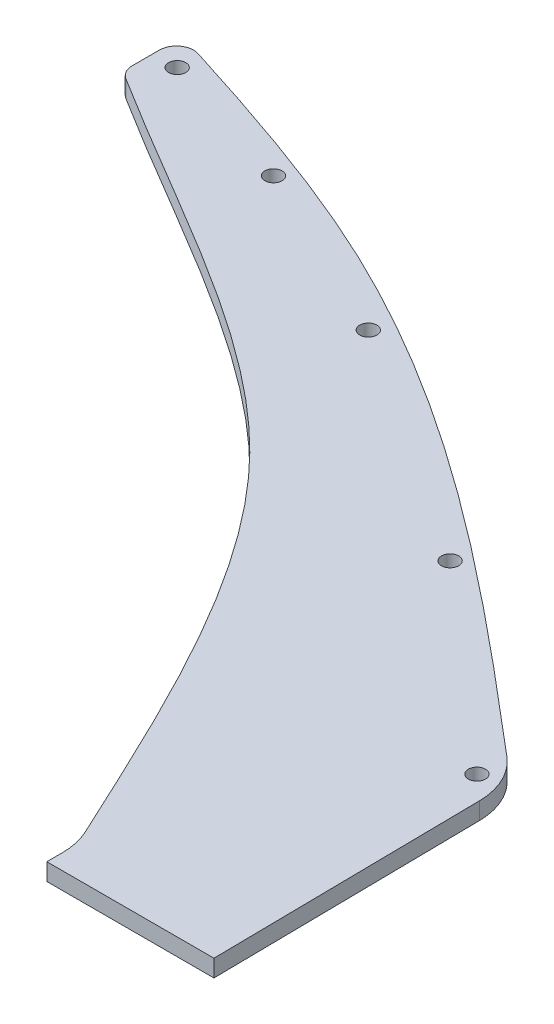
from build123d import *

# Parameters (mm, degrees)
EXTRUDE1_DEPTH = 6.35
SKETCH2_R      = 3.18135
EXTRUDE2_DEPTH = 390.45212174


with BuildPart() as part:
    # Sketch1 → Extrude1 (new body)
    with BuildSketch(Plane(origin=(0, 0, 0), x_dir=(1, 0, 0), z_dir=(0, 1, 0))):
        with BuildLine():
            Line((-49.074573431, -19.600728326), (-49.074573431, -25.403057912))
            Line((-49.074573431, -25.403057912), (-12.657224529, -25.403057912))
            Line((-12.657224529, -25.403057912), (12.750182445, -25.403057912))
            Line((12.750182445, -25.403057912), (11.438299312, 74.231566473))
            ThreePointArc((11.438299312, 74.231566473), (9.025402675, 84.707071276), (2.495549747, 93.246350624))
            add(Edge.make_bspline(
                [(2.495549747, 93.246350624), (-57.848467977, 144.56444124), (-143.95585957, 216.062245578), (-248.917518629, 251.686521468), (-280.025664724, 261.481050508)],
                knots=[0.030864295, 0.030864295, 0.030864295, 0.030864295, 0.666306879, 0.930191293, 0.930191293, 0.930191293, 0.930191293], degree=3))
            ThreePointArc((-280.025664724, 261.481050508), (-285.688548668, 260.544339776), (-288.282696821, 255.424176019))
            Line((-288.282696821, 255.424176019), (-288.282696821, 245.445848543))
            ThreePointArc((-288.282696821, 245.445848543), (-287.492950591, 242.378915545), (-285.320152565, 240.074848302))
            add(Edge.make_bspline(
                [(-51.457853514, -8.858726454), (-75.697090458, 43.078308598), (-106.05950577, 110.100776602), (-187.468809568, 185.164837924), (-243.910194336, 213.957850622), (-285.320152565, 240.074848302)],
                knots=[0.015452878, 0.015452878, 0.015452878, 0.015452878, 0.486791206, 0.584155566, 0.989096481, 0.989096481, 0.989096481, 0.989096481], degree=3))
            ThreePointArc((-51.457853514, -8.858726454), (-49.677550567, -14.099123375), (-49.074573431, -19.600728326))
        make_face()
    extrude(amount=EXTRUDE1_DEPTH)

    # Sketch2 → Extrude2 (cut, through all)
    with BuildSketch(Plane(origin=(0, 6.35, 0), x_dir=(1, 0, 0), z_dir=(0, 1, 0))):
        with Locations(Location((2.42519565, 82.207872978, 0), (0, 0, 270))):
            Circle(SKETCH2_R)
        with Locations(Location((-279.379146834, 253.126748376, 0), (0, 0, 270))):
            Circle(SKETCH2_R)
        with Locations(Location((-70.863834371, 145.578590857, 0), (0, 0, 270))):
            Circle(SKETCH2_R)
        with Locations(Location((-159.936390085, 204.386438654, 0), (0, 0, 270))):
            Circle(SKETCH2_R)
        with Locations(Location((-226.891855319, 236.255776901, 0), (0, 0, 270))):
            Circle(SKETCH2_R)
    extrude(amount=-EXTRUDE2_DEPTH, mode=Mode.SUBTRACT)


solid = part.part
